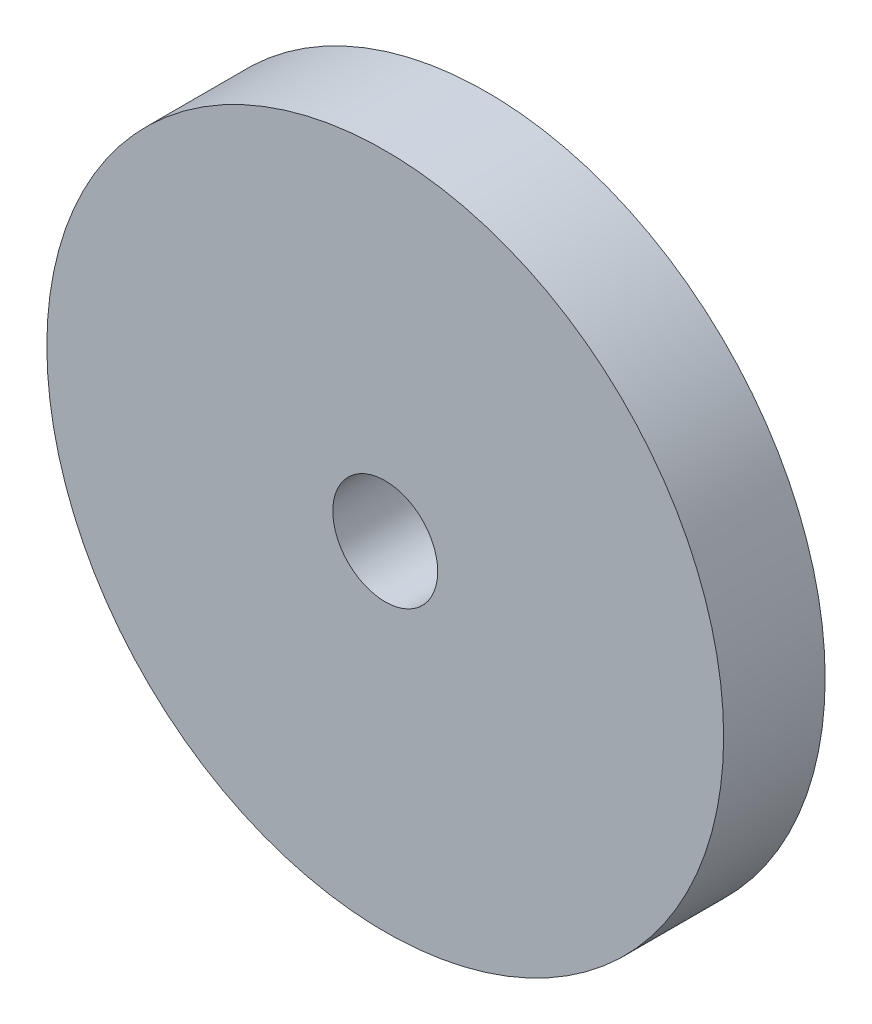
ISO-10303-21;
HEADER;
FILE_DESCRIPTION(('STEP AP214'),'2;1');
FILE_NAME('part.step','',(''),(''),'','','');
FILE_SCHEMA(('AUTOMOTIVE_DESIGN { 1 0 10303 214 1 1 1 1 }'));
ENDSEC;
DATA;
#1=APPLICATION_CONTEXT('core data for automotive mechanical design processes');
#2=APPLICATION_PROTOCOL_DEFINITION('international standard','automotive_design',2000,#1);
#3=PRODUCT_CONTEXT('',#1,'mechanical');
#4=PRODUCT('Part','Part','',(#3));
#5=PRODUCT_RELATED_PRODUCT_CATEGORY('part','',(#4));
#6=PRODUCT_DEFINITION_FORMATION('','',#4);
#7=PRODUCT_DEFINITION_CONTEXT('part definition',#1,'design');
#8=PRODUCT_DEFINITION('design','',#6,#7);
#9=PRODUCT_DEFINITION_SHAPE('','',#8);
#10=(LENGTH_UNIT() NAMED_UNIT(*) SI_UNIT(.MILLI.,.METRE.));
#11=(NAMED_UNIT(*) PLANE_ANGLE_UNIT() SI_UNIT($,.RADIAN.));
#12=(NAMED_UNIT(*) SI_UNIT($,.STERADIAN.) SOLID_ANGLE_UNIT());
#13=UNCERTAINTY_MEASURE_WITH_UNIT(LENGTH_MEASURE(1.E-05),#10,'distance_accuracy_value','');
#14=(GEOMETRIC_REPRESENTATION_CONTEXT(3) GLOBAL_UNCERTAINTY_ASSIGNED_CONTEXT((#13)) GLOBAL_UNIT_ASSIGNED_CONTEXT((#10,
#11,#12)) REPRESENTATION_CONTEXT('',''));
#15=CARTESIAN_POINT('',(0.,0.,0.));
#16=DIRECTION('',(0.,0.,1.));
#17=DIRECTION('',(1.,0.,0.));
#18=AXIS2_PLACEMENT_3D('',#15,#16,#17);
#19=CARTESIAN_POINT('',(0.,0.,6.));
#20=DIRECTION('',(0.,0.,1.));
#21=DIRECTION('',(1.,0.,0.));
#22=AXIS2_PLACEMENT_3D('',#19,#20,#21);
#23=PLANE('',#22);
#24=CARTESIAN_POINT('',(0.,0.,6.));
#25=DIRECTION('',(0.,0.,1.));
#26=DIRECTION('',(1.,0.,0.));
#27=AXIS2_PLACEMENT_3D('',#24,#25,#26);
#28=CIRCLE('',#27,20.);
#29=CARTESIAN_POINT('',(20.,0.,6.));
#30=VERTEX_POINT('',#29);
#31=EDGE_CURVE('E10',#30,#30,#28,.T.);
#32=ORIENTED_EDGE('',*,*,#31,.T.);
#33=EDGE_LOOP('',(#32));
#34=FACE_BOUND('',#33,.T.);
#35=CARTESIAN_POINT('',(0.,0.,6.));
#36=DIRECTION('',(0.,0.,1.));
#37=DIRECTION('',(1.,0.,0.));
#38=AXIS2_PLACEMENT_3D('',#35,#36,#37);
#39=CIRCLE('',#38,3.1);
#40=CARTESIAN_POINT('',(3.1,0.,6.));
#41=VERTEX_POINT('',#40);
#42=EDGE_CURVE('E40',#41,#41,#39,.T.);
#43=ORIENTED_EDGE('',*,*,#42,.F.);
#44=EDGE_LOOP('',(#43));
#45=FACE_BOUND('',#44,.T.);
#46=ADVANCED_FACE('F29',(#34,#45),#23,.T.);
#47=CARTESIAN_POINT('',(0.,0.,0.));
#48=DIRECTION('',(0.,0.,1.));
#49=DIRECTION('',(1.,0.,0.));
#50=AXIS2_PLACEMENT_3D('',#47,#48,#49);
#51=PLANE('',#50);
#52=CARTESIAN_POINT('',(0.,0.,0.));
#53=DIRECTION('',(0.,0.,1.));
#54=DIRECTION('',(1.,0.,0.));
#55=AXIS2_PLACEMENT_3D('',#52,#53,#54);
#56=CIRCLE('',#55,20.);
#57=CARTESIAN_POINT('',(20.,0.,0.));
#58=VERTEX_POINT('',#57);
#59=EDGE_CURVE('E36',#58,#58,#56,.T.);
#60=ORIENTED_EDGE('',*,*,#59,.F.);
#61=EDGE_LOOP('',(#60));
#62=FACE_BOUND('',#61,.T.);
#63=CARTESIAN_POINT('',(0.,0.,0.));
#64=DIRECTION('',(0.,0.,1.));
#65=DIRECTION('',(1.,0.,0.));
#66=AXIS2_PLACEMENT_3D('',#63,#64,#65);
#67=CIRCLE('',#66,3.1);
#68=CARTESIAN_POINT('',(3.1,0.,0.));
#69=VERTEX_POINT('',#68);
#70=EDGE_CURVE('E44',#69,#69,#67,.T.);
#71=ORIENTED_EDGE('',*,*,#70,.T.);
#72=EDGE_LOOP('',(#71));
#73=FACE_BOUND('',#72,.T.);
#74=ADVANCED_FACE('F50',(#62,#73),#51,.F.);
#75=CARTESIAN_POINT('',(0.,0.,6.));
#76=DIRECTION('',(0.,0.,-1.));
#77=DIRECTION('',(-1.,0.,0.));
#78=AXIS2_PLACEMENT_3D('',#75,#76,#77);
#79=CYLINDRICAL_SURFACE('',#78,20.);
#80=ORIENTED_EDGE('',*,*,#31,.F.);
#81=EDGE_LOOP('',(#80));
#82=FACE_BOUND('',#81,.T.);
#83=ORIENTED_EDGE('',*,*,#59,.T.);
#84=EDGE_LOOP('',(#83));
#85=FACE_BOUND('',#84,.T.);
#86=ADVANCED_FACE('F31',(#82,#85),#79,.T.);
#87=CARTESIAN_POINT('',(0.,0.,6.));
#88=DIRECTION('',(0.,0.,-1.));
#89=DIRECTION('',(-1.,0.,0.));
#90=AXIS2_PLACEMENT_3D('',#87,#88,#89);
#91=CYLINDRICAL_SURFACE('',#90,3.1);
#92=ORIENTED_EDGE('',*,*,#42,.T.);
#93=EDGE_LOOP('',(#92));
#94=FACE_BOUND('',#93,.T.);
#95=ORIENTED_EDGE('',*,*,#70,.F.);
#96=EDGE_LOOP('',(#95));
#97=FACE_BOUND('',#96,.T.);
#98=ADVANCED_FACE('F52',(#94,#97),#91,.F.);
#99=CLOSED_SHELL('',(#46,#74,#86,#98));
#100=MANIFOLD_SOLID_BREP('B2',#99);
#101=ADVANCED_BREP_SHAPE_REPRESENTATION('',(#18,#100),#14);
#102=SHAPE_DEFINITION_REPRESENTATION(#9,#101);
ENDSEC;
END-ISO-10303-21;
